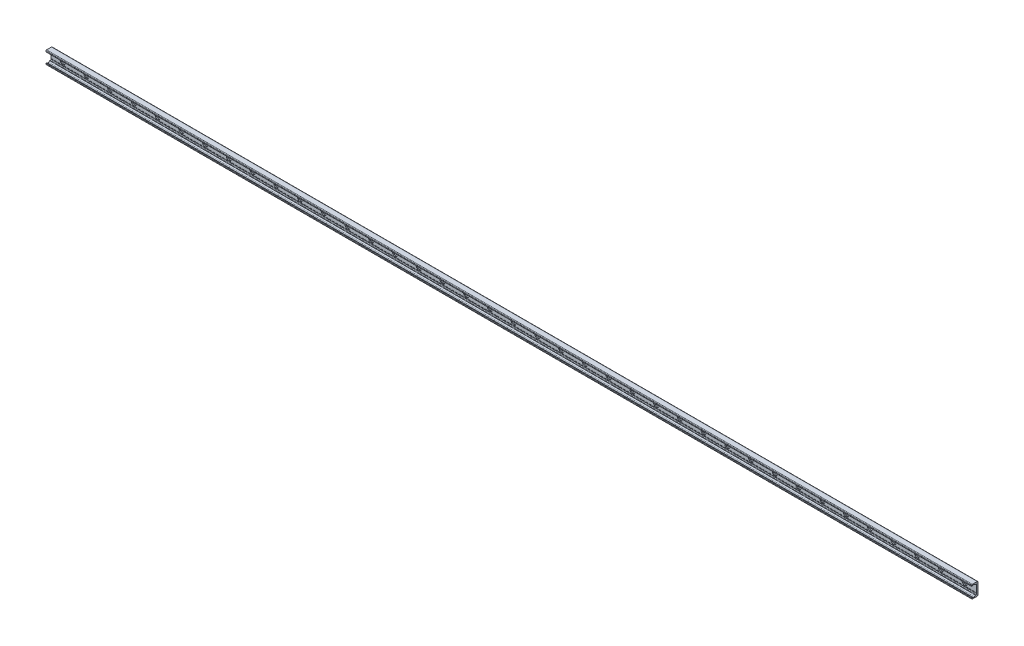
from build123d import *

# Parameters (mm, degrees)
BOSS_EXTRUDE1_DEPTH = 1560
SKETCH2_R           = 9
SKETCH2_R_2         = 4.5
CUT_EXTRUDE1_DEPTH  = 3.1
SKETCH2_2_R         = 4.5
CUT_EXTRUDE2_DEPTH  = 1561.235398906
LPATTERN1_COUNT     = 39
LPATTERN1_PITCH     = 80


with BuildPart() as part:
    # Sketch1 → Boss-Extrude1 (new, symmetric)
    with BuildSketch(Plane(origin=(0, 0, 0), x_dir=(0, 0, -1), z_dir=(1, 0, 0))):
        with BuildLine():
            Line((0, 0), (0, 19))
            ThreePointArc((0, 19), (-0.732233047, 20.767766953), (-2.5, 21.5))
            Line((-2.5, 21.5), (-19, 21.5))
            ThreePointArc((-19, 21.5), (-20.414213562, 20.914213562), (-21, 19.5))
            Line((-21, 19.5), (-21, 16.625057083))
            ThreePointArc((-21, 16.625057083), (-20.553251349, 15.888838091), (-19.693931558, 15.945160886))
            Line((-19.693931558, 15.945160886), (-16.794305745, 17.975500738))
            ThreePointArc((-16.794305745, 17.975500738), (-14.5, 18.69889256), (-12.205694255, 17.975500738))
            Line((-12.205694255, 17.975500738), (-8.829831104, 15.611695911))
            ThreePointArc((-8.829831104, 15.611695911), (-8.28408983, 15.342566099), (-7.682678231, 15.25))
            Line((-7.682678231, 15.25), (-6.5, 15.25))
            ThreePointArc((-6.5, 15.25), (-5.085786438, 14.664213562), (-4.5, 13.25))
            Line((-4.5, 13.25), (-4.5, -10.75))
            ThreePointArc((-4.5, -10.75), (-4.25, -11), (-4.5, -11.25))
            Line((-4.5, -11.25), (-4.5, -12.25))
            ThreePointArc((-4.5, -12.25), (-4.25, -12.5), (-4.5, -12.75))
            Line((-4.5, -12.75), (-4.5, -13.25))
            ThreePointArc((-4.5, -13.25), (-5.085786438, -14.664213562), (-6.5, -15.25))
            Line((-6.5, -15.25), (-7.682678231, -15.25))
            ThreePointArc((-7.682678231, -15.25), (-8.28408983, -15.342566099), (-8.829831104, -15.611695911))
            Line((-8.829831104, -15.611695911), (-12.205694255, -17.975500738))
            ThreePointArc((-12.205694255, -17.975500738), (-14.5, -18.69889256), (-16.794305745, -17.975500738))
            Line((-16.794305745, -17.975500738), (-19.693931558, -15.945160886))
            ThreePointArc((-19.693931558, -15.945160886), (-20.553251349, -15.888838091), (-21, -16.625057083))
            Line((-21, -16.625057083), (-21, -19.5))
            ThreePointArc((-21, -19.5), (-20.414213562, -20.914213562), (-19, -21.5))
            Line((-19, -21.5), (-2.5, -21.5))
            ThreePointArc((-2.5, -21.5), (-0.732233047, -20.767766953), (0, -19))
            Line((0, -19), (0, 0))
        make_face()
    extrude(amount=BOSS_EXTRUDE1_DEPTH, both=True)

    # Sketch2 → Cut-Extrude1 (cut)
    with BuildSketch(Plane.XY.offset(4.5)):
        with Locations((1520, 0)):
            Circle(SKETCH2_R)
        with Locations((1520, 0)):
            Circle(SKETCH2_R_2, mode=Mode.SUBTRACT)
    cut_extrude1 = extrude(amount=-CUT_EXTRUDE1_DEPTH, mode=Mode.SUBTRACT)

    # Sketch2_2 → Cut-Extrude2 (cut, through all)
    with BuildSketch(Plane.XY.offset(4.5)):
        with Locations((1520, 0)):
            Circle(SKETCH2_2_R)
    cut_extrude2 = extrude(amount=-CUT_EXTRUDE2_DEPTH, mode=Mode.SUBTRACT)

    # LPattern1: Cut-Extrude1, Cut-Extrude2 ×39
    with Locations(*[(-i * LPATTERN1_PITCH, 0, 0) for i in range(1, LPATTERN1_COUNT)]):
        add(cut_extrude1, mode=Mode.SUBTRACT)
        add(cut_extrude2, mode=Mode.SUBTRACT)


solid = part.part
